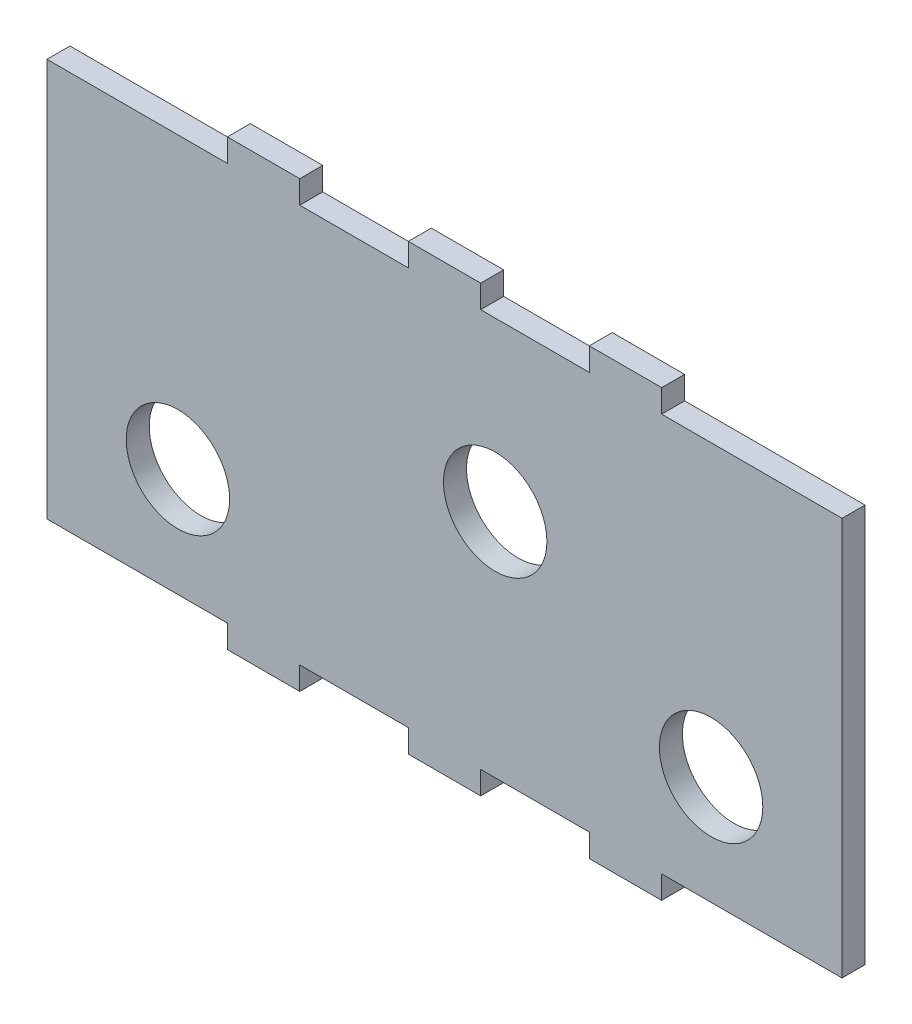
ISO-10303-21;
HEADER;
FILE_DESCRIPTION(('STEP AP214'),'2;1');
FILE_NAME('part.step','',(''),(''),'','','');
FILE_SCHEMA(('AUTOMOTIVE_DESIGN { 1 0 10303 214 1 1 1 1 }'));
ENDSEC;
DATA;
#1=APPLICATION_CONTEXT('core data for automotive mechanical design processes');
#2=APPLICATION_PROTOCOL_DEFINITION('international standard','automotive_design',2000,#1);
#3=PRODUCT_CONTEXT('',#1,'mechanical');
#4=PRODUCT('Part','Part','',(#3));
#5=PRODUCT_RELATED_PRODUCT_CATEGORY('part','',(#4));
#6=PRODUCT_DEFINITION_FORMATION('','',#4);
#7=PRODUCT_DEFINITION_CONTEXT('part definition',#1,'design');
#8=PRODUCT_DEFINITION('design','',#6,#7);
#9=PRODUCT_DEFINITION_SHAPE('','',#8);
#10=(LENGTH_UNIT() NAMED_UNIT(*) SI_UNIT(.MILLI.,.METRE.));
#11=(NAMED_UNIT(*) PLANE_ANGLE_UNIT() SI_UNIT($,.RADIAN.));
#12=(NAMED_UNIT(*) SI_UNIT($,.STERADIAN.) SOLID_ANGLE_UNIT());
#13=UNCERTAINTY_MEASURE_WITH_UNIT(LENGTH_MEASURE(1.E-05),#10,'distance_accuracy_value','');
#14=(GEOMETRIC_REPRESENTATION_CONTEXT(3) GLOBAL_UNCERTAINTY_ASSIGNED_CONTEXT((#13)) GLOBAL_UNIT_ASSIGNED_CONTEXT((#10,
#11,#12)) REPRESENTATION_CONTEXT('',''));
#15=CARTESIAN_POINT('',(0.,0.,0.));
#16=DIRECTION('',(0.,0.,1.));
#17=DIRECTION('',(1.,0.,0.));
#18=AXIS2_PLACEMENT_3D('',#15,#16,#17);
#19=CARTESIAN_POINT('',(0.,0.,6.35));
#20=DIRECTION('',(0.,0.,1.));
#21=DIRECTION('',(1.,0.,0.));
#22=AXIS2_PLACEMENT_3D('',#19,#20,#21);
#23=PLANE('',#22);
#24=CARTESIAN_POINT('',(183.5,30.,6.35));
#25=DIRECTION('',(0.,0.,1.));
#26=DIRECTION('',(1.,0.,0.));
#27=AXIS2_PLACEMENT_3D('',#24,#25,#26);
#28=CIRCLE('',#27,14.2875);
#29=CARTESIAN_POINT('',(197.7875,30.,6.35));
#30=VERTEX_POINT('',#29);
#31=EDGE_CURVE('E500',#30,#30,#28,.T.);
#32=ORIENTED_EDGE('',*,*,#31,.F.);
#33=EDGE_LOOP('',(#32));
#34=FACE_BOUND('',#33,.T.);
#35=DIRECTION('',(1.,0.,0.));
#36=VECTOR('',#35,1.);
#37=CARTESIAN_POINT('',(99.84,0.,6.35));
#38=LINE('',#37,#36);
#39=CARTESIAN_POINT('',(69.84,0.,6.35));
#40=VERTEX_POINT('',#39);
#41=CARTESIAN_POINT('',(99.84,0.,6.35));
#42=VERTEX_POINT('',#41);
#43=EDGE_CURVE('E311',#40,#42,#38,.T.);
#44=ORIENTED_EDGE('',*,*,#43,.T.);
#45=DIRECTION('',(0.,-1.,0.));
#46=VECTOR('',#45,1.);
#47=CARTESIAN_POINT('',(99.84,0.,6.35));
#48=LINE('',#47,#46);
#49=CARTESIAN_POINT('',(99.84,-6.34999999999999,6.35));
#50=VERTEX_POINT('',#49);
#51=EDGE_CURVE('E159',#42,#50,#48,.T.);
#52=ORIENTED_EDGE('',*,*,#51,.T.);
#53=DIRECTION('',(1.,0.,0.));
#54=VECTOR('',#53,1.);
#55=CARTESIAN_POINT('',(99.84,-6.34999999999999,6.35));
#56=LINE('',#55,#54);
#57=CARTESIAN_POINT('',(119.84,-6.34999999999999,6.35));
#58=VERTEX_POINT('',#57);
#59=EDGE_CURVE('E386',#50,#58,#56,.T.);
#60=ORIENTED_EDGE('',*,*,#59,.T.);
#61=DIRECTION('',(0.,1.,0.));
#62=VECTOR('',#61,1.);
#63=CARTESIAN_POINT('',(119.84,-6.34999999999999,6.35));
#64=LINE('',#63,#62);
#65=CARTESIAN_POINT('',(119.84,0.,6.35));
#66=VERTEX_POINT('',#65);
#67=EDGE_CURVE('E405',#58,#66,#64,.T.);
#68=ORIENTED_EDGE('',*,*,#67,.T.);
#69=DIRECTION('',(1.,0.,0.));
#70=VECTOR('',#69,1.);
#71=CARTESIAN_POINT('',(119.84,0.,6.35));
#72=LINE('',#71,#70);
#73=CARTESIAN_POINT('',(149.84,0.,6.35));
#74=VERTEX_POINT('',#73);
#75=EDGE_CURVE('E402',#66,#74,#72,.T.);
#76=ORIENTED_EDGE('',*,*,#75,.T.);
#77=DIRECTION('',(0.,-1.,0.));
#78=VECTOR('',#77,1.);
#79=CARTESIAN_POINT('',(149.84,0.,6.35));
#80=LINE('',#79,#78);
#81=CARTESIAN_POINT('',(149.84,-6.35000000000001,6.35));
#82=VERTEX_POINT('',#81);
#83=EDGE_CURVE('E404',#74,#82,#80,.T.);
#84=ORIENTED_EDGE('',*,*,#83,.T.);
#85=DIRECTION('',(1.,0.,0.));
#86=VECTOR('',#85,1.);
#87=CARTESIAN_POINT('',(149.84,-6.35000000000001,6.35));
#88=LINE('',#87,#86);
#89=CARTESIAN_POINT('',(169.84,-6.35000000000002,6.35));
#90=VERTEX_POINT('',#89);
#91=EDGE_CURVE('E407',#82,#90,#88,.T.);
#92=ORIENTED_EDGE('',*,*,#91,.T.);
#93=DIRECTION('',(0.,1.,0.));
#94=VECTOR('',#93,1.);
#95=CARTESIAN_POINT('',(169.84,-6.35000000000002,6.35));
#96=LINE('',#95,#94);
#97=CARTESIAN_POINT('',(169.84,0.,6.35));
#98=VERTEX_POINT('',#97);
#99=EDGE_CURVE('E413',#90,#98,#96,.T.);
#100=ORIENTED_EDGE('',*,*,#99,.T.);
#101=DIRECTION('',(1.,0.,0.));
#102=VECTOR('',#101,1.);
#103=CARTESIAN_POINT('',(169.84,0.,6.35));
#104=LINE('',#103,#102);
#105=CARTESIAN_POINT('',(219.68,0.,6.35));
#106=VERTEX_POINT('',#105);
#107=EDGE_CURVE('E415',#98,#106,#104,.T.);
#108=ORIENTED_EDGE('',*,*,#107,.T.);
#109=DIRECTION('',(0.,1.,0.));
#110=VECTOR('',#109,1.);
#111=CARTESIAN_POINT('',(219.68,0.,6.35));
#112=LINE('',#111,#110);
#113=CARTESIAN_POINT('',(219.68,110.,6.35));
#114=VERTEX_POINT('',#113);
#115=EDGE_CURVE('E417',#106,#114,#112,.T.);
#116=ORIENTED_EDGE('',*,*,#115,.T.);
#117=DIRECTION('',(-1.,0.,0.));
#118=VECTOR('',#117,1.);
#119=CARTESIAN_POINT('',(169.84,110.,6.35));
#120=LINE('',#119,#118);
#121=CARTESIAN_POINT('',(169.84,110.,6.35));
#122=VERTEX_POINT('',#121);
#123=EDGE_CURVE('E419',#114,#122,#120,.T.);
#124=ORIENTED_EDGE('',*,*,#123,.T.);
#125=DIRECTION('',(0.,1.,0.));
#126=VECTOR('',#125,1.);
#127=CARTESIAN_POINT('',(169.84,116.35,6.35));
#128=LINE('',#127,#126);
#129=CARTESIAN_POINT('',(169.84,116.35,6.35));
#130=VERTEX_POINT('',#129);
#131=EDGE_CURVE('E421',#122,#130,#128,.T.);
#132=ORIENTED_EDGE('',*,*,#131,.T.);
#133=DIRECTION('',(-1.,0.,0.));
#134=VECTOR('',#133,1.);
#135=CARTESIAN_POINT('',(149.84,116.35,6.35));
#136=LINE('',#135,#134);
#137=CARTESIAN_POINT('',(149.84,116.35,6.35));
#138=VERTEX_POINT('',#137);
#139=EDGE_CURVE('E423',#130,#138,#136,.T.);
#140=ORIENTED_EDGE('',*,*,#139,.T.);
#141=DIRECTION('',(0.,-1.,0.));
#142=VECTOR('',#141,1.);
#143=CARTESIAN_POINT('',(149.84,110.,6.35));
#144=LINE('',#143,#142);
#145=CARTESIAN_POINT('',(149.84,110.,6.35));
#146=VERTEX_POINT('',#145);
#147=EDGE_CURVE('E425',#138,#146,#144,.T.);
#148=ORIENTED_EDGE('',*,*,#147,.T.);
#149=DIRECTION('',(-1.,0.,0.));
#150=VECTOR('',#149,1.);
#151=CARTESIAN_POINT('',(119.84,110.,6.35));
#152=LINE('',#151,#150);
#153=CARTESIAN_POINT('',(119.84,110.,6.35));
#154=VERTEX_POINT('',#153);
#155=EDGE_CURVE('E427',#146,#154,#152,.T.);
#156=ORIENTED_EDGE('',*,*,#155,.T.);
#157=DIRECTION('',(0.,1.,0.));
#158=VECTOR('',#157,1.);
#159=CARTESIAN_POINT('',(119.84,116.35,6.35));
#160=LINE('',#159,#158);
#161=CARTESIAN_POINT('',(119.84,116.35,6.35));
#162=VERTEX_POINT('',#161);
#163=EDGE_CURVE('E429',#154,#162,#160,.T.);
#164=ORIENTED_EDGE('',*,*,#163,.T.);
#165=DIRECTION('',(-1.,0.,0.));
#166=VECTOR('',#165,1.);
#167=CARTESIAN_POINT('',(99.84,116.35,6.35));
#168=LINE('',#167,#166);
#169=CARTESIAN_POINT('',(99.84,116.35,6.35));
#170=VERTEX_POINT('',#169);
#171=EDGE_CURVE('E431',#162,#170,#168,.T.);
#172=ORIENTED_EDGE('',*,*,#171,.T.);
#173=DIRECTION('',(0.,-1.,0.));
#174=VECTOR('',#173,1.);
#175=CARTESIAN_POINT('',(99.84,110.,6.35));
#176=LINE('',#175,#174);
#177=CARTESIAN_POINT('',(99.84,110.,6.35));
#178=VERTEX_POINT('',#177);
#179=EDGE_CURVE('E433',#170,#178,#176,.T.);
#180=ORIENTED_EDGE('',*,*,#179,.T.);
#181=DIRECTION('',(-1.,0.,0.));
#182=VECTOR('',#181,1.);
#183=CARTESIAN_POINT('',(99.84,110.,6.35));
#184=LINE('',#183,#182);
#185=CARTESIAN_POINT('',(69.8399999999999,110.,6.35));
#186=VERTEX_POINT('',#185);
#187=EDGE_CURVE('E435',#178,#186,#184,.T.);
#188=ORIENTED_EDGE('',*,*,#187,.T.);
#189=DIRECTION('',(0.,1.,0.));
#190=VECTOR('',#189,1.);
#191=CARTESIAN_POINT('',(69.8399999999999,110.,6.35));
#192=LINE('',#191,#190);
#193=CARTESIAN_POINT('',(69.84,116.35,6.35));
#194=VERTEX_POINT('',#193);
#195=EDGE_CURVE('E437',#186,#194,#192,.T.);
#196=ORIENTED_EDGE('',*,*,#195,.T.);
#197=DIRECTION('',(-1.,0.,0.));
#198=VECTOR('',#197,1.);
#199=CARTESIAN_POINT('',(69.84,116.35,6.35));
#200=LINE('',#199,#198);
#201=CARTESIAN_POINT('',(49.84,116.35,6.35));
#202=VERTEX_POINT('',#201);
#203=EDGE_CURVE('E439',#194,#202,#200,.T.);
#204=ORIENTED_EDGE('',*,*,#203,.T.);
#205=DIRECTION('',(0.,-1.,0.));
#206=VECTOR('',#205,1.);
#207=CARTESIAN_POINT('',(49.84,116.35,6.35));
#208=LINE('',#207,#206);
#209=CARTESIAN_POINT('',(49.84,110.,6.35));
#210=VERTEX_POINT('',#209);
#211=EDGE_CURVE('E441',#202,#210,#208,.T.);
#212=ORIENTED_EDGE('',*,*,#211,.T.);
#213=DIRECTION('',(-1.,0.,0.));
#214=VECTOR('',#213,1.);
#215=CARTESIAN_POINT('',(49.84,110.,6.35));
#216=LINE('',#215,#214);
#217=CARTESIAN_POINT('',(0.,110.,6.35));
#218=VERTEX_POINT('',#217);
#219=EDGE_CURVE('E443',#210,#218,#216,.T.);
#220=ORIENTED_EDGE('',*,*,#219,.T.);
#221=DIRECTION('',(0.,-1.,0.));
#222=VECTOR('',#221,1.);
#223=CARTESIAN_POINT('',(0.,0.,6.35));
#224=LINE('',#223,#222);
#225=CARTESIAN_POINT('',(0.,0.,6.35));
#226=VERTEX_POINT('',#225);
#227=EDGE_CURVE('E445',#218,#226,#224,.T.);
#228=ORIENTED_EDGE('',*,*,#227,.T.);
#229=DIRECTION('',(1.,0.,0.));
#230=VECTOR('',#229,1.);
#231=CARTESIAN_POINT('',(49.84,0.,6.35));
#232=LINE('',#231,#230);
#233=CARTESIAN_POINT('',(49.84,0.,6.35));
#234=VERTEX_POINT('',#233);
#235=EDGE_CURVE('E238',#226,#234,#232,.T.);
#236=ORIENTED_EDGE('',*,*,#235,.T.);
#237=DIRECTION('',(0.,-1.,0.));
#238=VECTOR('',#237,1.);
#239=CARTESIAN_POINT('',(49.84,-6.35,6.35));
#240=LINE('',#239,#238);
#241=CARTESIAN_POINT('',(49.84,-6.35,6.35));
#242=VERTEX_POINT('',#241);
#243=EDGE_CURVE('E232',#234,#242,#240,.T.);
#244=ORIENTED_EDGE('',*,*,#243,.T.);
#245=DIRECTION('',(1.,0.,0.));
#246=VECTOR('',#245,1.);
#247=CARTESIAN_POINT('',(69.84,-6.34999999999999,6.35));
#248=LINE('',#247,#246);
#249=CARTESIAN_POINT('',(69.84,-6.34999999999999,6.35));
#250=VERTEX_POINT('',#249);
#251=EDGE_CURVE('E236',#242,#250,#248,.T.);
#252=ORIENTED_EDGE('',*,*,#251,.T.);
#253=DIRECTION('',(0.,1.,0.));
#254=VECTOR('',#253,1.);
#255=CARTESIAN_POINT('',(69.84,0.,6.35));
#256=LINE('',#255,#254);
#257=EDGE_CURVE('E56',#250,#40,#256,.T.);
#258=ORIENTED_EDGE('',*,*,#257,.T.);
#259=EDGE_LOOP('',(#44,#52,#60,#68,#76,#84,#92,#100,#108,#116,#124,#132,#140,#148,#156,#164,
#172,#180,#188,#196,#204,#212,#220,#228,#236,#244,#252,#258));
#260=FACE_BOUND('',#259,.T.);
#261=CARTESIAN_POINT('',(36.18,30.,6.35));
#262=DIRECTION('',(0.,0.,1.));
#263=DIRECTION('',(1.,0.,0.));
#264=AXIS2_PLACEMENT_3D('',#261,#262,#263);
#265=CIRCLE('',#264,14.2875);
#266=CARTESIAN_POINT('',(50.4675,30.,6.35));
#267=VERTEX_POINT('',#266);
#268=EDGE_CURVE('E260',#267,#267,#265,.T.);
#269=ORIENTED_EDGE('',*,*,#268,.F.);
#270=EDGE_LOOP('',(#269));
#271=FACE_BOUND('',#270,.T.);
#272=CARTESIAN_POINT('',(123.846374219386,63.6703865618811,6.35));
#273=DIRECTION('',(0.,0.,1.));
#274=DIRECTION('',(1.,0.,0.));
#275=AXIS2_PLACEMENT_3D('',#272,#273,#274);
#276=CIRCLE('',#275,14.2875);
#277=CARTESIAN_POINT('',(138.133874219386,63.6703865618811,6.35));
#278=VERTEX_POINT('',#277);
#279=EDGE_CURVE('E491',#278,#278,#276,.T.);
#280=ORIENTED_EDGE('',*,*,#279,.F.);
#281=EDGE_LOOP('',(#280));
#282=FACE_BOUND('',#281,.T.);
#283=ADVANCED_FACE('F39',(#34,#260,#271,#282),#23,.T.);
#284=CARTESIAN_POINT('',(0.,0.,0.));
#285=DIRECTION('',(0.,0.,1.));
#286=DIRECTION('',(1.,0.,0.));
#287=AXIS2_PLACEMENT_3D('',#284,#285,#286);
#288=PLANE('',#287);
#289=DIRECTION('',(1.,0.,0.));
#290=VECTOR('',#289,1.);
#291=CARTESIAN_POINT('',(99.84,0.,0.));
#292=LINE('',#291,#290);
#293=CARTESIAN_POINT('',(69.84,0.,0.));
#294=VERTEX_POINT('',#293);
#295=CARTESIAN_POINT('',(99.84,0.,0.));
#296=VERTEX_POINT('',#295);
#297=EDGE_CURVE('E256',#294,#296,#292,.T.);
#298=ORIENTED_EDGE('',*,*,#297,.F.);
#299=DIRECTION('',(0.,1.,0.));
#300=VECTOR('',#299,1.);
#301=CARTESIAN_POINT('',(69.84,0.,0.));
#302=LINE('',#301,#300);
#303=CARTESIAN_POINT('',(69.84,-6.34999999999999,0.));
#304=VERTEX_POINT('',#303);
#305=EDGE_CURVE('E151',#304,#294,#302,.T.);
#306=ORIENTED_EDGE('',*,*,#305,.F.);
#307=DIRECTION('',(1.,0.,0.));
#308=VECTOR('',#307,1.);
#309=CARTESIAN_POINT('',(69.84,-6.34999999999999,0.));
#310=LINE('',#309,#308);
#311=CARTESIAN_POINT('',(49.84,-6.35,0.));
#312=VERTEX_POINT('',#311);
#313=EDGE_CURVE('E145',#312,#304,#310,.T.);
#314=ORIENTED_EDGE('',*,*,#313,.F.);
#315=DIRECTION('',(0.,-1.,0.));
#316=VECTOR('',#315,1.);
#317=CARTESIAN_POINT('',(49.84,-6.35,0.));
#318=LINE('',#317,#316);
#319=CARTESIAN_POINT('',(49.84,0.,0.));
#320=VERTEX_POINT('',#319);
#321=EDGE_CURVE('E246',#320,#312,#318,.T.);
#322=ORIENTED_EDGE('',*,*,#321,.F.);
#323=DIRECTION('',(1.,0.,0.));
#324=VECTOR('',#323,1.);
#325=CARTESIAN_POINT('',(49.84,0.,0.));
#326=LINE('',#325,#324);
#327=CARTESIAN_POINT('',(0.,0.,0.));
#328=VERTEX_POINT('',#327);
#329=EDGE_CURVE('E306',#328,#320,#326,.T.);
#330=ORIENTED_EDGE('',*,*,#329,.F.);
#331=DIRECTION('',(0.,-1.,0.));
#332=VECTOR('',#331,1.);
#333=CARTESIAN_POINT('',(0.,0.,0.));
#334=LINE('',#333,#332);
#335=CARTESIAN_POINT('',(0.,110.,0.));
#336=VERTEX_POINT('',#335);
#337=EDGE_CURVE('E304',#336,#328,#334,.T.);
#338=ORIENTED_EDGE('',*,*,#337,.F.);
#339=DIRECTION('',(-1.,0.,0.));
#340=VECTOR('',#339,1.);
#341=CARTESIAN_POINT('',(49.84,110.,0.));
#342=LINE('',#341,#340);
#343=CARTESIAN_POINT('',(49.84,110.,0.));
#344=VERTEX_POINT('',#343);
#345=EDGE_CURVE('E302',#344,#336,#342,.T.);
#346=ORIENTED_EDGE('',*,*,#345,.F.);
#347=DIRECTION('',(0.,-1.,0.));
#348=VECTOR('',#347,1.);
#349=CARTESIAN_POINT('',(49.84,116.35,0.));
#350=LINE('',#349,#348);
#351=CARTESIAN_POINT('',(49.84,116.35,0.));
#352=VERTEX_POINT('',#351);
#353=EDGE_CURVE('E300',#352,#344,#350,.T.);
#354=ORIENTED_EDGE('',*,*,#353,.F.);
#355=DIRECTION('',(-1.,0.,0.));
#356=VECTOR('',#355,1.);
#357=CARTESIAN_POINT('',(69.84,116.35,0.));
#358=LINE('',#357,#356);
#359=CARTESIAN_POINT('',(69.84,116.35,0.));
#360=VERTEX_POINT('',#359);
#361=EDGE_CURVE('E298',#360,#352,#358,.T.);
#362=ORIENTED_EDGE('',*,*,#361,.F.);
#363=DIRECTION('',(0.,1.,0.));
#364=VECTOR('',#363,1.);
#365=CARTESIAN_POINT('',(69.8399999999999,110.,0.));
#366=LINE('',#365,#364);
#367=CARTESIAN_POINT('',(69.8399999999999,110.,0.));
#368=VERTEX_POINT('',#367);
#369=EDGE_CURVE('E296',#368,#360,#366,.T.);
#370=ORIENTED_EDGE('',*,*,#369,.F.);
#371=DIRECTION('',(-1.,0.,0.));
#372=VECTOR('',#371,1.);
#373=CARTESIAN_POINT('',(99.84,110.,0.));
#374=LINE('',#373,#372);
#375=CARTESIAN_POINT('',(99.84,110.,0.));
#376=VERTEX_POINT('',#375);
#377=EDGE_CURVE('E294',#376,#368,#374,.T.);
#378=ORIENTED_EDGE('',*,*,#377,.F.);
#379=DIRECTION('',(0.,-1.,0.));
#380=VECTOR('',#379,1.);
#381=CARTESIAN_POINT('',(99.84,110.,0.));
#382=LINE('',#381,#380);
#383=CARTESIAN_POINT('',(99.84,116.35,0.));
#384=VERTEX_POINT('',#383);
#385=EDGE_CURVE('E292',#384,#376,#382,.T.);
#386=ORIENTED_EDGE('',*,*,#385,.F.);
#387=DIRECTION('',(-1.,0.,0.));
#388=VECTOR('',#387,1.);
#389=CARTESIAN_POINT('',(99.84,116.35,0.));
#390=LINE('',#389,#388);
#391=CARTESIAN_POINT('',(119.84,116.35,0.));
#392=VERTEX_POINT('',#391);
#393=EDGE_CURVE('E290',#392,#384,#390,.T.);
#394=ORIENTED_EDGE('',*,*,#393,.F.);
#395=DIRECTION('',(0.,1.,0.));
#396=VECTOR('',#395,1.);
#397=CARTESIAN_POINT('',(119.84,116.35,0.));
#398=LINE('',#397,#396);
#399=CARTESIAN_POINT('',(119.84,110.,0.));
#400=VERTEX_POINT('',#399);
#401=EDGE_CURVE('E288',#400,#392,#398,.T.);
#402=ORIENTED_EDGE('',*,*,#401,.F.);
#403=DIRECTION('',(-1.,0.,0.));
#404=VECTOR('',#403,1.);
#405=CARTESIAN_POINT('',(119.84,110.,0.));
#406=LINE('',#405,#404);
#407=CARTESIAN_POINT('',(149.84,110.,0.));
#408=VERTEX_POINT('',#407);
#409=EDGE_CURVE('E286',#408,#400,#406,.T.);
#410=ORIENTED_EDGE('',*,*,#409,.F.);
#411=DIRECTION('',(0.,-1.,0.));
#412=VECTOR('',#411,1.);
#413=CARTESIAN_POINT('',(149.84,110.,0.));
#414=LINE('',#413,#412);
#415=CARTESIAN_POINT('',(149.84,116.35,0.));
#416=VERTEX_POINT('',#415);
#417=EDGE_CURVE('E284',#416,#408,#414,.T.);
#418=ORIENTED_EDGE('',*,*,#417,.F.);
#419=DIRECTION('',(-1.,0.,0.));
#420=VECTOR('',#419,1.);
#421=CARTESIAN_POINT('',(149.84,116.35,0.));
#422=LINE('',#421,#420);
#423=CARTESIAN_POINT('',(169.84,116.35,0.));
#424=VERTEX_POINT('',#423);
#425=EDGE_CURVE('E282',#424,#416,#422,.T.);
#426=ORIENTED_EDGE('',*,*,#425,.F.);
#427=DIRECTION('',(0.,1.,0.));
#428=VECTOR('',#427,1.);
#429=CARTESIAN_POINT('',(169.84,116.35,0.));
#430=LINE('',#429,#428);
#431=CARTESIAN_POINT('',(169.84,110.,0.));
#432=VERTEX_POINT('',#431);
#433=EDGE_CURVE('E280',#432,#424,#430,.T.);
#434=ORIENTED_EDGE('',*,*,#433,.F.);
#435=DIRECTION('',(-1.,0.,0.));
#436=VECTOR('',#435,1.);
#437=CARTESIAN_POINT('',(169.84,110.,0.));
#438=LINE('',#437,#436);
#439=CARTESIAN_POINT('',(219.68,110.,0.));
#440=VERTEX_POINT('',#439);
#441=EDGE_CURVE('E278',#440,#432,#438,.T.);
#442=ORIENTED_EDGE('',*,*,#441,.F.);
#443=DIRECTION('',(0.,1.,0.));
#444=VECTOR('',#443,1.);
#445=CARTESIAN_POINT('',(219.68,0.,0.));
#446=LINE('',#445,#444);
#447=CARTESIAN_POINT('',(219.68,0.,0.));
#448=VERTEX_POINT('',#447);
#449=EDGE_CURVE('E276',#448,#440,#446,.T.);
#450=ORIENTED_EDGE('',*,*,#449,.F.);
#451=DIRECTION('',(1.,0.,0.));
#452=VECTOR('',#451,1.);
#453=CARTESIAN_POINT('',(169.84,0.,0.));
#454=LINE('',#453,#452);
#455=CARTESIAN_POINT('',(169.84,0.,0.));
#456=VERTEX_POINT('',#455);
#457=EDGE_CURVE('E274',#456,#448,#454,.T.);
#458=ORIENTED_EDGE('',*,*,#457,.F.);
#459=DIRECTION('',(0.,1.,0.));
#460=VECTOR('',#459,1.);
#461=CARTESIAN_POINT('',(169.84,-6.35000000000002,0.));
#462=LINE('',#461,#460);
#463=CARTESIAN_POINT('',(169.84,-6.35000000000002,0.));
#464=VERTEX_POINT('',#463);
#465=EDGE_CURVE('E272',#464,#456,#462,.T.);
#466=ORIENTED_EDGE('',*,*,#465,.F.);
#467=DIRECTION('',(1.,0.,0.));
#468=VECTOR('',#467,1.);
#469=CARTESIAN_POINT('',(149.84,-6.35000000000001,0.));
#470=LINE('',#469,#468);
#471=CARTESIAN_POINT('',(149.84,-6.35000000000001,0.));
#472=VERTEX_POINT('',#471);
#473=EDGE_CURVE('E270',#472,#464,#470,.T.);
#474=ORIENTED_EDGE('',*,*,#473,.F.);
#475=DIRECTION('',(0.,-1.,0.));
#476=VECTOR('',#475,1.);
#477=CARTESIAN_POINT('',(149.84,0.,0.));
#478=LINE('',#477,#476);
#479=CARTESIAN_POINT('',(149.84,0.,0.));
#480=VERTEX_POINT('',#479);
#481=EDGE_CURVE('E268',#480,#472,#478,.T.);
#482=ORIENTED_EDGE('',*,*,#481,.F.);
#483=DIRECTION('',(1.,0.,0.));
#484=VECTOR('',#483,1.);
#485=CARTESIAN_POINT('',(119.84,0.,0.));
#486=LINE('',#485,#484);
#487=CARTESIAN_POINT('',(119.84,0.,0.));
#488=VERTEX_POINT('',#487);
#489=EDGE_CURVE('E266',#488,#480,#486,.T.);
#490=ORIENTED_EDGE('',*,*,#489,.F.);
#491=DIRECTION('',(0.,1.,0.));
#492=VECTOR('',#491,1.);
#493=CARTESIAN_POINT('',(119.84,-6.34999999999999,0.));
#494=LINE('',#493,#492);
#495=CARTESIAN_POINT('',(119.84,-6.34999999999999,0.));
#496=VERTEX_POINT('',#495);
#497=EDGE_CURVE('E264',#496,#488,#494,.T.);
#498=ORIENTED_EDGE('',*,*,#497,.F.);
#499=DIRECTION('',(1.,0.,0.));
#500=VECTOR('',#499,1.);
#501=CARTESIAN_POINT('',(99.84,-6.34999999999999,0.));
#502=LINE('',#501,#500);
#503=CARTESIAN_POINT('',(99.84,-6.34999999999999,0.));
#504=VERTEX_POINT('',#503);
#505=EDGE_CURVE('E262',#504,#496,#502,.T.);
#506=ORIENTED_EDGE('',*,*,#505,.F.);
#507=DIRECTION('',(0.,-1.,0.));
#508=VECTOR('',#507,1.);
#509=CARTESIAN_POINT('',(99.84,0.,0.));
#510=LINE('',#509,#508);
#511=EDGE_CURVE('E259',#296,#504,#510,.T.);
#512=ORIENTED_EDGE('',*,*,#511,.F.);
#513=EDGE_LOOP('',(#298,#306,#314,#322,#330,#338,#346,#354,#362,#370,#378,#386,#394,#402,#410,
#418,#426,#434,#442,#450,#458,#466,#474,#482,#490,#498,#506,#512));
#514=FACE_BOUND('',#513,.T.);
#515=CARTESIAN_POINT('',(36.18,30.,0.));
#516=DIRECTION('',(0.,0.,1.));
#517=DIRECTION('',(1.,0.,0.));
#518=AXIS2_PLACEMENT_3D('',#515,#516,#517);
#519=CIRCLE('',#518,14.2875);
#520=CARTESIAN_POINT('',(50.4675,30.,0.));
#521=VERTEX_POINT('',#520);
#522=EDGE_CURVE('E503',#521,#521,#519,.T.);
#523=ORIENTED_EDGE('',*,*,#522,.T.);
#524=EDGE_LOOP('',(#523));
#525=FACE_BOUND('',#524,.T.);
#526=CARTESIAN_POINT('',(183.5,30.,0.));
#527=DIRECTION('',(0.,0.,1.));
#528=DIRECTION('',(1.,0.,0.));
#529=AXIS2_PLACEMENT_3D('',#526,#527,#528);
#530=CIRCLE('',#529,14.2875);
#531=CARTESIAN_POINT('',(197.7875,30.,0.));
#532=VERTEX_POINT('',#531);
#533=EDGE_CURVE('E497',#532,#532,#530,.T.);
#534=ORIENTED_EDGE('',*,*,#533,.T.);
#535=EDGE_LOOP('',(#534));
#536=FACE_BOUND('',#535,.T.);
#537=CARTESIAN_POINT('',(123.846374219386,63.6703865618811,0.));
#538=DIRECTION('',(0.,0.,1.));
#539=DIRECTION('',(1.,0.,0.));
#540=AXIS2_PLACEMENT_3D('',#537,#538,#539);
#541=CIRCLE('',#540,14.2875);
#542=CARTESIAN_POINT('',(138.133874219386,63.6703865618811,0.));
#543=VERTEX_POINT('',#542);
#544=EDGE_CURVE('E494',#543,#543,#541,.T.);
#545=ORIENTED_EDGE('',*,*,#544,.T.);
#546=EDGE_LOOP('',(#545));
#547=FACE_BOUND('',#546,.T.);
#548=ADVANCED_FACE('F390',(#514,#525,#536,#547),#288,.F.);
#549=CARTESIAN_POINT('',(99.84,0.,6.35));
#550=DIRECTION('',(0.,1.,0.));
#551=DIRECTION('',(-1.,0.,0.));
#552=AXIS2_PLACEMENT_3D('',#549,#550,#551);
#553=PLANE('',#552);
#554=ORIENTED_EDGE('',*,*,#297,.T.);
#555=DIRECTION('',(0.,0.,-1.));
#556=VECTOR('',#555,1.);
#557=CARTESIAN_POINT('',(99.84,0.,6.35));
#558=LINE('',#557,#556);
#559=EDGE_CURVE('E11',#42,#296,#558,.T.);
#560=ORIENTED_EDGE('',*,*,#559,.F.);
#561=ORIENTED_EDGE('',*,*,#43,.F.);
#562=DIRECTION('',(0.,0.,-1.));
#563=VECTOR('',#562,1.);
#564=CARTESIAN_POINT('',(69.84,0.,6.35));
#565=LINE('',#564,#563);
#566=EDGE_CURVE('E252',#40,#294,#565,.T.);
#567=ORIENTED_EDGE('',*,*,#566,.T.);
#568=EDGE_LOOP('',(#554,#560,#561,#567));
#569=FACE_BOUND('',#568,.T.);
#570=ADVANCED_FACE('F41',(#569),#553,.F.);
#571=CARTESIAN_POINT('',(99.84,0.,6.35));
#572=DIRECTION('',(1.,0.,0.));
#573=DIRECTION('',(0.,0.,-1.));
#574=AXIS2_PLACEMENT_3D('',#571,#572,#573);
#575=PLANE('',#574);
#576=ORIENTED_EDGE('',*,*,#511,.T.);
#577=DIRECTION('',(0.,0.,-1.));
#578=VECTOR('',#577,1.);
#579=CARTESIAN_POINT('',(99.84,-6.34999999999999,6.35));
#580=LINE('',#579,#578);
#581=EDGE_CURVE('E48',#50,#504,#580,.T.);
#582=ORIENTED_EDGE('',*,*,#581,.F.);
#583=ORIENTED_EDGE('',*,*,#51,.F.);
#584=ORIENTED_EDGE('',*,*,#559,.T.);
#585=EDGE_LOOP('',(#576,#582,#583,#584));
#586=FACE_BOUND('',#585,.T.);
#587=ADVANCED_FACE('F791',(#586),#575,.F.);
#588=CARTESIAN_POINT('',(99.84,-6.34999999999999,6.35));
#589=DIRECTION('',(0.,1.,0.));
#590=DIRECTION('',(-1.,0.,0.));
#591=AXIS2_PLACEMENT_3D('',#588,#589,#590);
#592=PLANE('',#591);
#593=ORIENTED_EDGE('',*,*,#505,.T.);
#594=DIRECTION('',(0.,0.,-1.));
#595=VECTOR('',#594,1.);
#596=CARTESIAN_POINT('',(119.84,-6.34999999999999,6.35));
#597=LINE('',#596,#595);
#598=EDGE_CURVE('E378',#58,#496,#597,.T.);
#599=ORIENTED_EDGE('',*,*,#598,.F.);
#600=ORIENTED_EDGE('',*,*,#59,.F.);
#601=ORIENTED_EDGE('',*,*,#581,.T.);
#602=EDGE_LOOP('',(#593,#599,#600,#601));
#603=FACE_BOUND('',#602,.T.);
#604=ADVANCED_FACE('F384',(#603),#592,.F.);
#605=CARTESIAN_POINT('',(119.84,-6.34999999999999,6.35));
#606=DIRECTION('',(-1.,0.,0.));
#607=DIRECTION('',(0.,-1.,0.));
#608=AXIS2_PLACEMENT_3D('',#605,#606,#607);
#609=PLANE('',#608);
#610=ORIENTED_EDGE('',*,*,#497,.T.);
#611=DIRECTION('',(0.,0.,-1.));
#612=VECTOR('',#611,1.);
#613=CARTESIAN_POINT('',(119.84,0.,6.35));
#614=LINE('',#613,#612);
#615=EDGE_CURVE('E375',#66,#488,#614,.T.);
#616=ORIENTED_EDGE('',*,*,#615,.F.);
#617=ORIENTED_EDGE('',*,*,#67,.F.);
#618=ORIENTED_EDGE('',*,*,#598,.T.);
#619=EDGE_LOOP('',(#610,#616,#617,#618));
#620=FACE_BOUND('',#619,.T.);
#621=ADVANCED_FACE('F396',(#620),#609,.F.);
#622=CARTESIAN_POINT('',(119.84,0.,6.35));
#623=DIRECTION('',(0.,1.,0.));
#624=DIRECTION('',(-1.,0.,0.));
#625=AXIS2_PLACEMENT_3D('',#622,#623,#624);
#626=PLANE('',#625);
#627=ORIENTED_EDGE('',*,*,#489,.T.);
#628=DIRECTION('',(0.,0.,-1.));
#629=VECTOR('',#628,1.);
#630=CARTESIAN_POINT('',(149.84,0.,6.35));
#631=LINE('',#630,#629);
#632=EDGE_CURVE('E372',#74,#480,#631,.T.);
#633=ORIENTED_EDGE('',*,*,#632,.F.);
#634=ORIENTED_EDGE('',*,*,#75,.F.);
#635=ORIENTED_EDGE('',*,*,#615,.T.);
#636=EDGE_LOOP('',(#627,#633,#634,#635));
#637=FACE_BOUND('',#636,.T.);
#638=ADVANCED_FACE('F400',(#637),#626,.F.);
#639=CARTESIAN_POINT('',(149.84,0.,6.35));
#640=DIRECTION('',(1.,0.,0.));
#641=DIRECTION('',(0.,1.,0.));
#642=AXIS2_PLACEMENT_3D('',#639,#640,#641);
#643=PLANE('',#642);
#644=ORIENTED_EDGE('',*,*,#481,.T.);
#645=DIRECTION('',(0.,0.,-1.));
#646=VECTOR('',#645,1.);
#647=CARTESIAN_POINT('',(149.84,-6.35000000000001,6.35));
#648=LINE('',#647,#646);
#649=EDGE_CURVE('E369',#82,#472,#648,.T.);
#650=ORIENTED_EDGE('',*,*,#649,.F.);
#651=ORIENTED_EDGE('',*,*,#83,.F.);
#652=ORIENTED_EDGE('',*,*,#632,.T.);
#653=EDGE_LOOP('',(#644,#650,#651,#652));
#654=FACE_BOUND('',#653,.T.);
#655=ADVANCED_FACE('F752',(#654),#643,.F.);
#656=CARTESIAN_POINT('',(149.84,-6.35000000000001,6.35));
#657=DIRECTION('',(0.,1.,0.));
#658=DIRECTION('',(-1.,0.,0.));
#659=AXIS2_PLACEMENT_3D('',#656,#657,#658);
#660=PLANE('',#659);
#661=ORIENTED_EDGE('',*,*,#473,.T.);
#662=DIRECTION('',(0.,0.,-1.));
#663=VECTOR('',#662,1.);
#664=CARTESIAN_POINT('',(169.84,-6.35000000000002,6.35));
#665=LINE('',#664,#663);
#666=EDGE_CURVE('E366',#90,#464,#665,.T.);
#667=ORIENTED_EDGE('',*,*,#666,.F.);
#668=ORIENTED_EDGE('',*,*,#91,.F.);
#669=ORIENTED_EDGE('',*,*,#649,.T.);
#670=EDGE_LOOP('',(#661,#667,#668,#669));
#671=FACE_BOUND('',#670,.T.);
#672=ADVANCED_FACE('F741',(#671),#660,.F.);
#673=CARTESIAN_POINT('',(169.84,-6.35000000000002,6.35));
#674=DIRECTION('',(-1.,0.,0.));
#675=DIRECTION('',(0.,-1.,0.));
#676=AXIS2_PLACEMENT_3D('',#673,#674,#675);
#677=PLANE('',#676);
#678=ORIENTED_EDGE('',*,*,#465,.T.);
#679=DIRECTION('',(0.,0.,-1.));
#680=VECTOR('',#679,1.);
#681=CARTESIAN_POINT('',(169.84,0.,6.35));
#682=LINE('',#681,#680);
#683=EDGE_CURVE('E363',#98,#456,#682,.T.);
#684=ORIENTED_EDGE('',*,*,#683,.F.);
#685=ORIENTED_EDGE('',*,*,#99,.F.);
#686=ORIENTED_EDGE('',*,*,#666,.T.);
#687=EDGE_LOOP('',(#678,#684,#685,#686));
#688=FACE_BOUND('',#687,.T.);
#689=ADVANCED_FACE('F730',(#688),#677,.F.);
#690=CARTESIAN_POINT('',(169.84,0.,6.35));
#691=DIRECTION('',(0.,1.,0.));
#692=DIRECTION('',(-1.,0.,0.));
#693=AXIS2_PLACEMENT_3D('',#690,#691,#692);
#694=PLANE('',#693);
#695=ORIENTED_EDGE('',*,*,#457,.T.);
#696=DIRECTION('',(0.,0.,-1.));
#697=VECTOR('',#696,1.);
#698=CARTESIAN_POINT('',(219.68,0.,6.35));
#699=LINE('',#698,#697);
#700=EDGE_CURVE('E360',#106,#448,#699,.T.);
#701=ORIENTED_EDGE('',*,*,#700,.F.);
#702=ORIENTED_EDGE('',*,*,#107,.F.);
#703=ORIENTED_EDGE('',*,*,#683,.T.);
#704=EDGE_LOOP('',(#695,#701,#702,#703));
#705=FACE_BOUND('',#704,.T.);
#706=ADVANCED_FACE('F719',(#705),#694,.F.);
#707=CARTESIAN_POINT('',(219.68,0.,6.35));
#708=DIRECTION('',(-1.,0.,0.));
#709=DIRECTION('',(0.,0.,1.));
#710=AXIS2_PLACEMENT_3D('',#707,#708,#709);
#711=PLANE('',#710);
#712=ORIENTED_EDGE('',*,*,#449,.T.);
#713=DIRECTION('',(0.,0.,-1.));
#714=VECTOR('',#713,1.);
#715=CARTESIAN_POINT('',(219.68,110.,6.35));
#716=LINE('',#715,#714);
#717=EDGE_CURVE('E357',#114,#440,#716,.T.);
#718=ORIENTED_EDGE('',*,*,#717,.F.);
#719=ORIENTED_EDGE('',*,*,#115,.F.);
#720=ORIENTED_EDGE('',*,*,#700,.T.);
#721=EDGE_LOOP('',(#712,#718,#719,#720));
#722=FACE_BOUND('',#721,.T.);
#723=ADVANCED_FACE('F708',(#722),#711,.F.);
#724=CARTESIAN_POINT('',(169.84,110.,6.35));
#725=DIRECTION('',(0.,-1.,0.));
#726=DIRECTION('',(1.,0.,0.));
#727=AXIS2_PLACEMENT_3D('',#724,#725,#726);
#728=PLANE('',#727);
#729=ORIENTED_EDGE('',*,*,#441,.T.);
#730=DIRECTION('',(0.,0.,-1.));
#731=VECTOR('',#730,1.);
#732=CARTESIAN_POINT('',(169.84,110.,6.35));
#733=LINE('',#732,#731);
#734=EDGE_CURVE('E354',#122,#432,#733,.T.);
#735=ORIENTED_EDGE('',*,*,#734,.F.);
#736=ORIENTED_EDGE('',*,*,#123,.F.);
#737=ORIENTED_EDGE('',*,*,#717,.T.);
#738=EDGE_LOOP('',(#729,#735,#736,#737));
#739=FACE_BOUND('',#738,.T.);
#740=ADVANCED_FACE('F697',(#739),#728,.F.);
#741=CARTESIAN_POINT('',(169.84,116.35,6.35));
#742=DIRECTION('',(-1.,0.,0.));
#743=DIRECTION('',(0.,-1.,0.));
#744=AXIS2_PLACEMENT_3D('',#741,#742,#743);
#745=PLANE('',#744);
#746=ORIENTED_EDGE('',*,*,#433,.T.);
#747=DIRECTION('',(0.,0.,-1.));
#748=VECTOR('',#747,1.);
#749=CARTESIAN_POINT('',(169.84,116.35,6.35));
#750=LINE('',#749,#748);
#751=EDGE_CURVE('E351',#130,#424,#750,.T.);
#752=ORIENTED_EDGE('',*,*,#751,.F.);
#753=ORIENTED_EDGE('',*,*,#131,.F.);
#754=ORIENTED_EDGE('',*,*,#734,.T.);
#755=EDGE_LOOP('',(#746,#752,#753,#754));
#756=FACE_BOUND('',#755,.T.);
#757=ADVANCED_FACE('F686',(#756),#745,.F.);
#758=CARTESIAN_POINT('',(149.84,116.35,6.35));
#759=DIRECTION('',(0.,-1.,0.));
#760=DIRECTION('',(0.,0.,-1.));
#761=AXIS2_PLACEMENT_3D('',#758,#759,#760);
#762=PLANE('',#761);
#763=ORIENTED_EDGE('',*,*,#425,.T.);
#764=DIRECTION('',(0.,0.,-1.));
#765=VECTOR('',#764,1.);
#766=CARTESIAN_POINT('',(149.84,116.35,6.35));
#767=LINE('',#766,#765);
#768=EDGE_CURVE('E348',#138,#416,#767,.T.);
#769=ORIENTED_EDGE('',*,*,#768,.F.);
#770=ORIENTED_EDGE('',*,*,#139,.F.);
#771=ORIENTED_EDGE('',*,*,#751,.T.);
#772=EDGE_LOOP('',(#763,#769,#770,#771));
#773=FACE_BOUND('',#772,.T.);
#774=ADVANCED_FACE('F675',(#773),#762,.F.);
#775=CARTESIAN_POINT('',(149.84,110.,6.35));
#776=DIRECTION('',(1.,0.,0.));
#777=DIRECTION('',(0.,1.,0.));
#778=AXIS2_PLACEMENT_3D('',#775,#776,#777);
#779=PLANE('',#778);
#780=ORIENTED_EDGE('',*,*,#417,.T.);
#781=DIRECTION('',(0.,0.,-1.));
#782=VECTOR('',#781,1.);
#783=CARTESIAN_POINT('',(149.84,110.,6.35));
#784=LINE('',#783,#782);
#785=EDGE_CURVE('E345',#146,#408,#784,.T.);
#786=ORIENTED_EDGE('',*,*,#785,.F.);
#787=ORIENTED_EDGE('',*,*,#147,.F.);
#788=ORIENTED_EDGE('',*,*,#768,.T.);
#789=EDGE_LOOP('',(#780,#786,#787,#788));
#790=FACE_BOUND('',#789,.T.);
#791=ADVANCED_FACE('F664',(#790),#779,.F.);
#792=CARTESIAN_POINT('',(119.84,110.,6.35));
#793=DIRECTION('',(0.,-1.,0.));
#794=DIRECTION('',(0.,0.,-1.));
#795=AXIS2_PLACEMENT_3D('',#792,#793,#794);
#796=PLANE('',#795);
#797=ORIENTED_EDGE('',*,*,#409,.T.);
#798=DIRECTION('',(0.,0.,-1.));
#799=VECTOR('',#798,1.);
#800=CARTESIAN_POINT('',(119.84,110.,6.35));
#801=LINE('',#800,#799);
#802=EDGE_CURVE('E342',#154,#400,#801,.T.);
#803=ORIENTED_EDGE('',*,*,#802,.F.);
#804=ORIENTED_EDGE('',*,*,#155,.F.);
#805=ORIENTED_EDGE('',*,*,#785,.T.);
#806=EDGE_LOOP('',(#797,#803,#804,#805));
#807=FACE_BOUND('',#806,.T.);
#808=ADVANCED_FACE('F653',(#807),#796,.F.);
#809=CARTESIAN_POINT('',(119.84,116.35,6.35));
#810=DIRECTION('',(-1.,0.,0.));
#811=DIRECTION('',(0.,-1.,0.));
#812=AXIS2_PLACEMENT_3D('',#809,#810,#811);
#813=PLANE('',#812);
#814=ORIENTED_EDGE('',*,*,#401,.T.);
#815=DIRECTION('',(0.,0.,-1.));
#816=VECTOR('',#815,1.);
#817=CARTESIAN_POINT('',(119.84,116.35,6.35));
#818=LINE('',#817,#816);
#819=EDGE_CURVE('E339',#162,#392,#818,.T.);
#820=ORIENTED_EDGE('',*,*,#819,.F.);
#821=ORIENTED_EDGE('',*,*,#163,.F.);
#822=ORIENTED_EDGE('',*,*,#802,.T.);
#823=EDGE_LOOP('',(#814,#820,#821,#822));
#824=FACE_BOUND('',#823,.T.);
#825=ADVANCED_FACE('F642',(#824),#813,.F.);
#826=CARTESIAN_POINT('',(99.84,116.35,6.35));
#827=DIRECTION('',(0.,-1.,0.));
#828=DIRECTION('',(0.,0.,-1.));
#829=AXIS2_PLACEMENT_3D('',#826,#827,#828);
#830=PLANE('',#829);
#831=ORIENTED_EDGE('',*,*,#393,.T.);
#832=DIRECTION('',(0.,0.,-1.));
#833=VECTOR('',#832,1.);
#834=CARTESIAN_POINT('',(99.84,116.35,6.35));
#835=LINE('',#834,#833);
#836=EDGE_CURVE('E336',#170,#384,#835,.T.);
#837=ORIENTED_EDGE('',*,*,#836,.F.);
#838=ORIENTED_EDGE('',*,*,#171,.F.);
#839=ORIENTED_EDGE('',*,*,#819,.T.);
#840=EDGE_LOOP('',(#831,#837,#838,#839));
#841=FACE_BOUND('',#840,.T.);
#842=ADVANCED_FACE('F631',(#841),#830,.F.);
#843=CARTESIAN_POINT('',(99.84,110.,6.35));
#844=DIRECTION('',(1.,0.,0.));
#845=DIRECTION('',(0.,1.,0.));
#846=AXIS2_PLACEMENT_3D('',#843,#844,#845);
#847=PLANE('',#846);
#848=ORIENTED_EDGE('',*,*,#385,.T.);
#849=DIRECTION('',(0.,0.,-1.));
#850=VECTOR('',#849,1.);
#851=CARTESIAN_POINT('',(99.84,110.,6.35));
#852=LINE('',#851,#850);
#853=EDGE_CURVE('E333',#178,#376,#852,.T.);
#854=ORIENTED_EDGE('',*,*,#853,.F.);
#855=ORIENTED_EDGE('',*,*,#179,.F.);
#856=ORIENTED_EDGE('',*,*,#836,.T.);
#857=EDGE_LOOP('',(#848,#854,#855,#856));
#858=FACE_BOUND('',#857,.T.);
#859=ADVANCED_FACE('F620',(#858),#847,.F.);
#860=CARTESIAN_POINT('',(99.84,110.,6.35));
#861=DIRECTION('',(0.,-1.,0.));
#862=DIRECTION('',(1.,0.,0.));
#863=AXIS2_PLACEMENT_3D('',#860,#861,#862);
#864=PLANE('',#863);
#865=ORIENTED_EDGE('',*,*,#377,.T.);
#866=DIRECTION('',(0.,0.,-1.));
#867=VECTOR('',#866,1.);
#868=CARTESIAN_POINT('',(69.8399999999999,110.,6.35));
#869=LINE('',#868,#867);
#870=EDGE_CURVE('E330',#186,#368,#869,.T.);
#871=ORIENTED_EDGE('',*,*,#870,.F.);
#872=ORIENTED_EDGE('',*,*,#187,.F.);
#873=ORIENTED_EDGE('',*,*,#853,.T.);
#874=EDGE_LOOP('',(#865,#871,#872,#873));
#875=FACE_BOUND('',#874,.T.);
#876=ADVANCED_FACE('F609',(#875),#864,.F.);
#877=CARTESIAN_POINT('',(69.8399999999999,110.,6.35));
#878=DIRECTION('',(-1.,0.,0.));
#879=DIRECTION('',(0.,-1.,0.));
#880=AXIS2_PLACEMENT_3D('',#877,#878,#879);
#881=PLANE('',#880);
#882=ORIENTED_EDGE('',*,*,#369,.T.);
#883=DIRECTION('',(0.,0.,-1.));
#884=VECTOR('',#883,1.);
#885=CARTESIAN_POINT('',(69.84,116.35,6.35));
#886=LINE('',#885,#884);
#887=EDGE_CURVE('E327',#194,#360,#886,.T.);
#888=ORIENTED_EDGE('',*,*,#887,.F.);
#889=ORIENTED_EDGE('',*,*,#195,.F.);
#890=ORIENTED_EDGE('',*,*,#870,.T.);
#891=EDGE_LOOP('',(#882,#888,#889,#890));
#892=FACE_BOUND('',#891,.T.);
#893=ADVANCED_FACE('F598',(#892),#881,.F.);
#894=CARTESIAN_POINT('',(69.84,116.35,6.35));
#895=DIRECTION('',(0.,-1.,0.));
#896=DIRECTION('',(0.,0.,-1.));
#897=AXIS2_PLACEMENT_3D('',#894,#895,#896);
#898=PLANE('',#897);
#899=ORIENTED_EDGE('',*,*,#361,.T.);
#900=DIRECTION('',(0.,0.,-1.));
#901=VECTOR('',#900,1.);
#902=CARTESIAN_POINT('',(49.84,116.35,6.35));
#903=LINE('',#902,#901);
#904=EDGE_CURVE('E324',#202,#352,#903,.T.);
#905=ORIENTED_EDGE('',*,*,#904,.F.);
#906=ORIENTED_EDGE('',*,*,#203,.F.);
#907=ORIENTED_EDGE('',*,*,#887,.T.);
#908=EDGE_LOOP('',(#899,#905,#906,#907));
#909=FACE_BOUND('',#908,.T.);
#910=ADVANCED_FACE('F587',(#909),#898,.F.);
#911=CARTESIAN_POINT('',(49.84,116.35,6.35));
#912=DIRECTION('',(1.,0.,0.));
#913=DIRECTION('',(0.,1.,0.));
#914=AXIS2_PLACEMENT_3D('',#911,#912,#913);
#915=PLANE('',#914);
#916=ORIENTED_EDGE('',*,*,#353,.T.);
#917=DIRECTION('',(0.,0.,-1.));
#918=VECTOR('',#917,1.);
#919=CARTESIAN_POINT('',(49.84,110.,6.35));
#920=LINE('',#919,#918);
#921=EDGE_CURVE('E321',#210,#344,#920,.T.);
#922=ORIENTED_EDGE('',*,*,#921,.F.);
#923=ORIENTED_EDGE('',*,*,#211,.F.);
#924=ORIENTED_EDGE('',*,*,#904,.T.);
#925=EDGE_LOOP('',(#916,#922,#923,#924));
#926=FACE_BOUND('',#925,.T.);
#927=ADVANCED_FACE('F576',(#926),#915,.F.);
#928=CARTESIAN_POINT('',(49.84,110.,6.35));
#929=DIRECTION('',(0.,-1.,0.));
#930=DIRECTION('',(1.,0.,0.));
#931=AXIS2_PLACEMENT_3D('',#928,#929,#930);
#932=PLANE('',#931);
#933=ORIENTED_EDGE('',*,*,#345,.T.);
#934=DIRECTION('',(0.,0.,-1.));
#935=VECTOR('',#934,1.);
#936=CARTESIAN_POINT('',(0.,110.,6.35));
#937=LINE('',#936,#935);
#938=EDGE_CURVE('E318',#218,#336,#937,.T.);
#939=ORIENTED_EDGE('',*,*,#938,.F.);
#940=ORIENTED_EDGE('',*,*,#219,.F.);
#941=ORIENTED_EDGE('',*,*,#921,.T.);
#942=EDGE_LOOP('',(#933,#939,#940,#941));
#943=FACE_BOUND('',#942,.T.);
#944=ADVANCED_FACE('F566',(#943),#932,.F.);
#945=CARTESIAN_POINT('',(0.,0.,6.35));
#946=DIRECTION('',(1.,0.,0.));
#947=DIRECTION('',(0.,0.,-1.));
#948=AXIS2_PLACEMENT_3D('',#945,#946,#947);
#949=PLANE('',#948);
#950=ORIENTED_EDGE('',*,*,#337,.T.);
#951=DIRECTION('',(0.,0.,-1.));
#952=VECTOR('',#951,1.);
#953=CARTESIAN_POINT('',(0.,0.,6.35));
#954=LINE('',#953,#952);
#955=EDGE_CURVE('E315',#226,#328,#954,.T.);
#956=ORIENTED_EDGE('',*,*,#955,.F.);
#957=ORIENTED_EDGE('',*,*,#227,.F.);
#958=ORIENTED_EDGE('',*,*,#938,.T.);
#959=EDGE_LOOP('',(#950,#956,#957,#958));
#960=FACE_BOUND('',#959,.T.);
#961=ADVANCED_FACE('F451',(#960),#949,.F.);
#962=CARTESIAN_POINT('',(49.84,0.,6.35));
#963=DIRECTION('',(0.,1.,0.));
#964=DIRECTION('',(-1.,0.,0.));
#965=AXIS2_PLACEMENT_3D('',#962,#963,#964);
#966=PLANE('',#965);
#967=ORIENTED_EDGE('',*,*,#329,.T.);
#968=DIRECTION('',(0.,0.,-1.));
#969=VECTOR('',#968,1.);
#970=CARTESIAN_POINT('',(49.84,0.,6.35));
#971=LINE('',#970,#969);
#972=EDGE_CURVE('E247',#234,#320,#971,.T.);
#973=ORIENTED_EDGE('',*,*,#972,.F.);
#974=ORIENTED_EDGE('',*,*,#235,.F.);
#975=ORIENTED_EDGE('',*,*,#955,.T.);
#976=EDGE_LOOP('',(#967,#973,#974,#975));
#977=FACE_BOUND('',#976,.T.);
#978=ADVANCED_FACE('F455',(#977),#966,.F.);
#979=CARTESIAN_POINT('',(49.84,-6.35,6.35));
#980=DIRECTION('',(1.,0.,0.));
#981=DIRECTION('',(0.,1.,0.));
#982=AXIS2_PLACEMENT_3D('',#979,#980,#981);
#983=PLANE('',#982);
#984=ORIENTED_EDGE('',*,*,#321,.T.);
#985=DIRECTION('',(0.,0.,-1.));
#986=VECTOR('',#985,1.);
#987=CARTESIAN_POINT('',(49.84,-6.35,6.35));
#988=LINE('',#987,#986);
#989=EDGE_CURVE('E243',#242,#312,#988,.T.);
#990=ORIENTED_EDGE('',*,*,#989,.F.);
#991=ORIENTED_EDGE('',*,*,#243,.F.);
#992=ORIENTED_EDGE('',*,*,#972,.T.);
#993=EDGE_LOOP('',(#984,#990,#991,#992));
#994=FACE_BOUND('',#993,.T.);
#995=ADVANCED_FACE('F244',(#994),#983,.F.);
#996=CARTESIAN_POINT('',(69.84,-6.34999999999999,6.35));
#997=DIRECTION('',(0.,1.,0.));
#998=DIRECTION('',(-1.,0.,0.));
#999=AXIS2_PLACEMENT_3D('',#996,#997,#998);
#1000=PLANE('',#999);
#1001=ORIENTED_EDGE('',*,*,#313,.T.);
#1002=DIRECTION('',(0.,0.,-1.));
#1003=VECTOR('',#1002,1.);
#1004=CARTESIAN_POINT('',(69.84,-6.34999999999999,6.35));
#1005=LINE('',#1004,#1003);
#1006=EDGE_CURVE('E248',#250,#304,#1005,.T.);
#1007=ORIENTED_EDGE('',*,*,#1006,.F.);
#1008=ORIENTED_EDGE('',*,*,#251,.F.);
#1009=ORIENTED_EDGE('',*,*,#989,.T.);
#1010=EDGE_LOOP('',(#1001,#1007,#1008,#1009));
#1011=FACE_BOUND('',#1010,.T.);
#1012=ADVANCED_FACE('F250',(#1011),#1000,.F.);
#1013=CARTESIAN_POINT('',(69.84,0.,6.35));
#1014=DIRECTION('',(-1.,0.,0.));
#1015=DIRECTION('',(0.,0.,1.));
#1016=AXIS2_PLACEMENT_3D('',#1013,#1014,#1015);
#1017=PLANE('',#1016);
#1018=ORIENTED_EDGE('',*,*,#305,.T.);
#1019=ORIENTED_EDGE('',*,*,#566,.F.);
#1020=ORIENTED_EDGE('',*,*,#257,.F.);
#1021=ORIENTED_EDGE('',*,*,#1006,.T.);
#1022=EDGE_LOOP('',(#1018,#1019,#1020,#1021));
#1023=FACE_BOUND('',#1022,.T.);
#1024=ADVANCED_FACE('F459',(#1023),#1017,.F.);
#1025=CARTESIAN_POINT('',(36.18,30.,6.35));
#1026=DIRECTION('',(0.,0.,-1.));
#1027=DIRECTION('',(-1.,0.,0.));
#1028=AXIS2_PLACEMENT_3D('',#1025,#1026,#1027);
#1029=CYLINDRICAL_SURFACE('',#1028,14.2875);
#1030=ORIENTED_EDGE('',*,*,#268,.T.);
#1031=EDGE_LOOP('',(#1030));
#1032=FACE_BOUND('',#1031,.T.);
#1033=ORIENTED_EDGE('',*,*,#522,.F.);
#1034=EDGE_LOOP('',(#1033));
#1035=FACE_BOUND('',#1034,.T.);
#1036=ADVANCED_FACE('F461',(#1032,#1035),#1029,.F.);
#1037=CARTESIAN_POINT('',(183.5,30.,6.35));
#1038=DIRECTION('',(0.,0.,-1.));
#1039=DIRECTION('',(-1.,0.,0.));
#1040=AXIS2_PLACEMENT_3D('',#1037,#1038,#1039);
#1041=CYLINDRICAL_SURFACE('',#1040,14.2875);
#1042=ORIENTED_EDGE('',*,*,#31,.T.);
#1043=EDGE_LOOP('',(#1042));
#1044=FACE_BOUND('',#1043,.T.);
#1045=ORIENTED_EDGE('',*,*,#533,.F.);
#1046=EDGE_LOOP('',(#1045));
#1047=FACE_BOUND('',#1046,.T.);
#1048=ADVANCED_FACE('F467',(#1044,#1047),#1041,.F.);
#1049=CARTESIAN_POINT('',(123.846374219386,63.6703865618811,6.35));
#1050=DIRECTION('',(0.,0.,-1.));
#1051=DIRECTION('',(-1.,0.,0.));
#1052=AXIS2_PLACEMENT_3D('',#1049,#1050,#1051);
#1053=CYLINDRICAL_SURFACE('',#1052,14.2875);
#1054=ORIENTED_EDGE('',*,*,#279,.T.);
#1055=EDGE_LOOP('',(#1054));
#1056=FACE_BOUND('',#1055,.T.);
#1057=ORIENTED_EDGE('',*,*,#544,.F.);
#1058=EDGE_LOOP('',(#1057));
#1059=FACE_BOUND('',#1058,.T.);
#1060=ADVANCED_FACE('F482',(#1056,#1059),#1053,.F.);
#1061=CLOSED_SHELL('',(#283,#548,#570,#587,#604,#621,#638,#655,#672,#689,#706,#723,#740,#757,
#774,#791,#808,#825,#842,#859,#876,#893,#910,#927,#944,#961,#978,#995,#1012,#1024,#1036,#1048,#1060));
#1062=MANIFOLD_SOLID_BREP('B2',#1061);
#1063=ADVANCED_BREP_SHAPE_REPRESENTATION('',(#18,#1062),#14);
#1064=SHAPE_DEFINITION_REPRESENTATION(#9,#1063);
ENDSEC;
END-ISO-10303-21;
